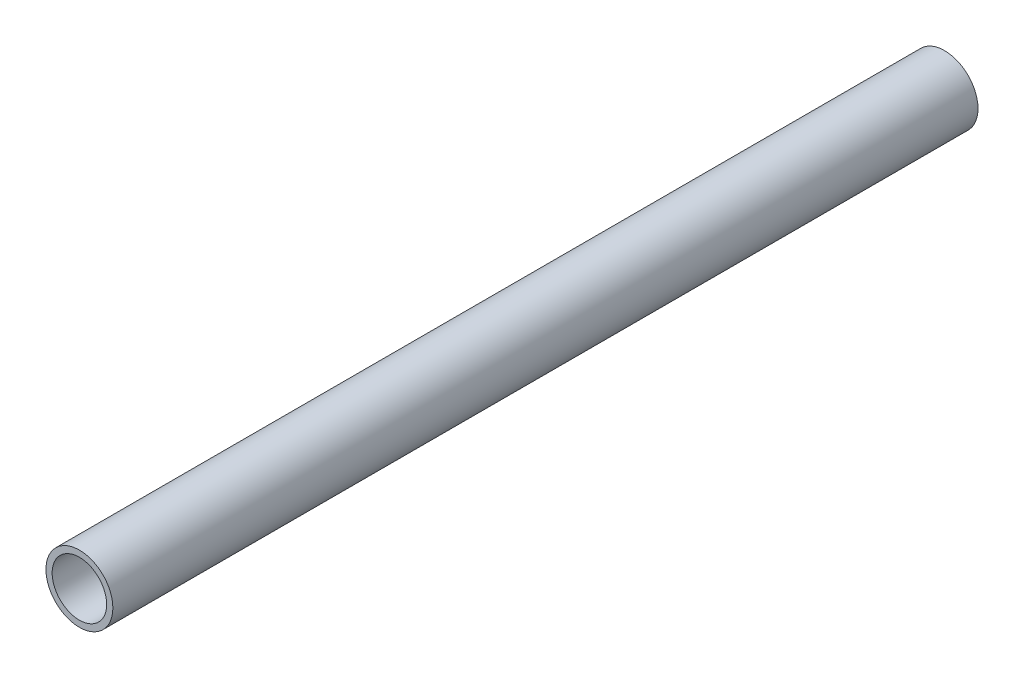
ISO-10303-21;
HEADER;
FILE_DESCRIPTION(('STEP AP214'),'2;1');
FILE_NAME('part.step','',(''),(''),'','','');
FILE_SCHEMA(('AUTOMOTIVE_DESIGN { 1 0 10303 214 1 1 1 1 }'));
ENDSEC;
DATA;
#1=APPLICATION_CONTEXT('core data for automotive mechanical design processes');
#2=APPLICATION_PROTOCOL_DEFINITION('international standard','automotive_design',2000,#1);
#3=PRODUCT_CONTEXT('',#1,'mechanical');
#4=PRODUCT('Part','Part','',(#3));
#5=PRODUCT_RELATED_PRODUCT_CATEGORY('part','',(#4));
#6=PRODUCT_DEFINITION_FORMATION('','',#4);
#7=PRODUCT_DEFINITION_CONTEXT('part definition',#1,'design');
#8=PRODUCT_DEFINITION('design','',#6,#7);
#9=PRODUCT_DEFINITION_SHAPE('','',#8);
#10=(LENGTH_UNIT() NAMED_UNIT(*) SI_UNIT(.MILLI.,.METRE.));
#11=(NAMED_UNIT(*) PLANE_ANGLE_UNIT() SI_UNIT($,.RADIAN.));
#12=(NAMED_UNIT(*) SI_UNIT($,.STERADIAN.) SOLID_ANGLE_UNIT());
#13=UNCERTAINTY_MEASURE_WITH_UNIT(LENGTH_MEASURE(1.E-05),#10,'distance_accuracy_value','');
#14=(GEOMETRIC_REPRESENTATION_CONTEXT(3) GLOBAL_UNCERTAINTY_ASSIGNED_CONTEXT((#13)) GLOBAL_UNIT_ASSIGNED_CONTEXT((#10,
#11,#12)) REPRESENTATION_CONTEXT('',''));
#15=CARTESIAN_POINT('',(0.,0.,0.));
#16=DIRECTION('',(0.,0.,1.));
#17=DIRECTION('',(1.,0.,0.));
#18=AXIS2_PLACEMENT_3D('',#15,#16,#17);
#19=CARTESIAN_POINT('',(0.,0.,-205.232));
#20=DIRECTION('',(0.,0.,1.));
#21=DIRECTION('',(1.,0.,0.));
#22=AXIS2_PLACEMENT_3D('',#19,#20,#21);
#23=CYLINDRICAL_SURFACE('',#22,7.9375);
#24=CARTESIAN_POINT('',(0.,0.,-205.232));
#25=DIRECTION('',(0.,0.,1.));
#26=DIRECTION('',(1.,0.,0.));
#27=AXIS2_PLACEMENT_3D('',#24,#25,#26);
#28=CIRCLE('',#27,7.9375);
#29=CARTESIAN_POINT('',(7.9375,0.,-205.232));
#30=VERTEX_POINT('',#29);
#31=EDGE_CURVE('E10',#30,#30,#28,.T.);
#32=ORIENTED_EDGE('',*,*,#31,.T.);
#33=EDGE_LOOP('',(#32));
#34=FACE_BOUND('',#33,.T.);
#35=CARTESIAN_POINT('',(0.,0.,0.));
#36=DIRECTION('',(0.,0.,1.));
#37=DIRECTION('',(1.,0.,0.));
#38=AXIS2_PLACEMENT_3D('',#35,#36,#37);
#39=CIRCLE('',#38,7.9375);
#40=CARTESIAN_POINT('',(7.9375,0.,0.));
#41=VERTEX_POINT('',#40);
#42=EDGE_CURVE('E40',#41,#41,#39,.T.);
#43=ORIENTED_EDGE('',*,*,#42,.F.);
#44=EDGE_LOOP('',(#43));
#45=FACE_BOUND('',#44,.T.);
#46=ADVANCED_FACE('F34',(#34,#45),#23,.T.);
#47=CARTESIAN_POINT('',(0.,0.,-205.232));
#48=DIRECTION('',(0.,0.,1.));
#49=DIRECTION('',(1.,0.,0.));
#50=AXIS2_PLACEMENT_3D('',#47,#48,#49);
#51=PLANE('',#50);
#52=CARTESIAN_POINT('',(0.,0.,-205.232));
#53=DIRECTION('',(0.,0.,1.));
#54=DIRECTION('',(1.,0.,0.));
#55=AXIS2_PLACEMENT_3D('',#52,#53,#54);
#56=CIRCLE('',#55,6.4643);
#57=CARTESIAN_POINT('',(6.4643,0.,-205.232));
#58=VERTEX_POINT('',#57);
#59=EDGE_CURVE('E44',#58,#58,#56,.T.);
#60=ORIENTED_EDGE('',*,*,#59,.T.);
#61=EDGE_LOOP('',(#60));
#62=FACE_BOUND('',#61,.T.);
#63=ORIENTED_EDGE('',*,*,#31,.F.);
#64=EDGE_LOOP('',(#63));
#65=FACE_BOUND('',#64,.T.);
#66=ADVANCED_FACE('F58',(#62,#65),#51,.F.);
#67=CARTESIAN_POINT('',(0.,0.,0.));
#68=DIRECTION('',(0.,0.,1.));
#69=DIRECTION('',(1.,0.,0.));
#70=AXIS2_PLACEMENT_3D('',#67,#68,#69);
#71=PLANE('',#70);
#72=CARTESIAN_POINT('',(0.,0.,0.));
#73=DIRECTION('',(0.,0.,1.));
#74=DIRECTION('',(1.,0.,0.));
#75=AXIS2_PLACEMENT_3D('',#72,#73,#74);
#76=CIRCLE('',#75,6.4643);
#77=CARTESIAN_POINT('',(6.4643,0.,0.));
#78=VERTEX_POINT('',#77);
#79=EDGE_CURVE('E48',#78,#78,#76,.T.);
#80=ORIENTED_EDGE('',*,*,#79,.F.);
#81=EDGE_LOOP('',(#80));
#82=FACE_BOUND('',#81,.T.);
#83=ORIENTED_EDGE('',*,*,#42,.T.);
#84=EDGE_LOOP('',(#83));
#85=FACE_BOUND('',#84,.T.);
#86=ADVANCED_FACE('F56',(#82,#85),#71,.T.);
#87=CARTESIAN_POINT('',(0.,0.,-205.232));
#88=DIRECTION('',(0.,0.,1.));
#89=DIRECTION('',(1.,0.,0.));
#90=AXIS2_PLACEMENT_3D('',#87,#88,#89);
#91=CYLINDRICAL_SURFACE('',#90,6.4643);
#92=ORIENTED_EDGE('',*,*,#59,.F.);
#93=EDGE_LOOP('',(#92));
#94=FACE_BOUND('',#93,.T.);
#95=ORIENTED_EDGE('',*,*,#79,.T.);
#96=EDGE_LOOP('',(#95));
#97=FACE_BOUND('',#96,.T.);
#98=ADVANCED_FACE('F54',(#94,#97),#91,.F.);
#99=CLOSED_SHELL('',(#46,#66,#86,#98));
#100=MANIFOLD_SOLID_BREP('B2',#99);
#101=ADVANCED_BREP_SHAPE_REPRESENTATION('',(#18,#100),#14);
#102=SHAPE_DEFINITION_REPRESENTATION(#9,#101);
ENDSEC;
END-ISO-10303-21;
